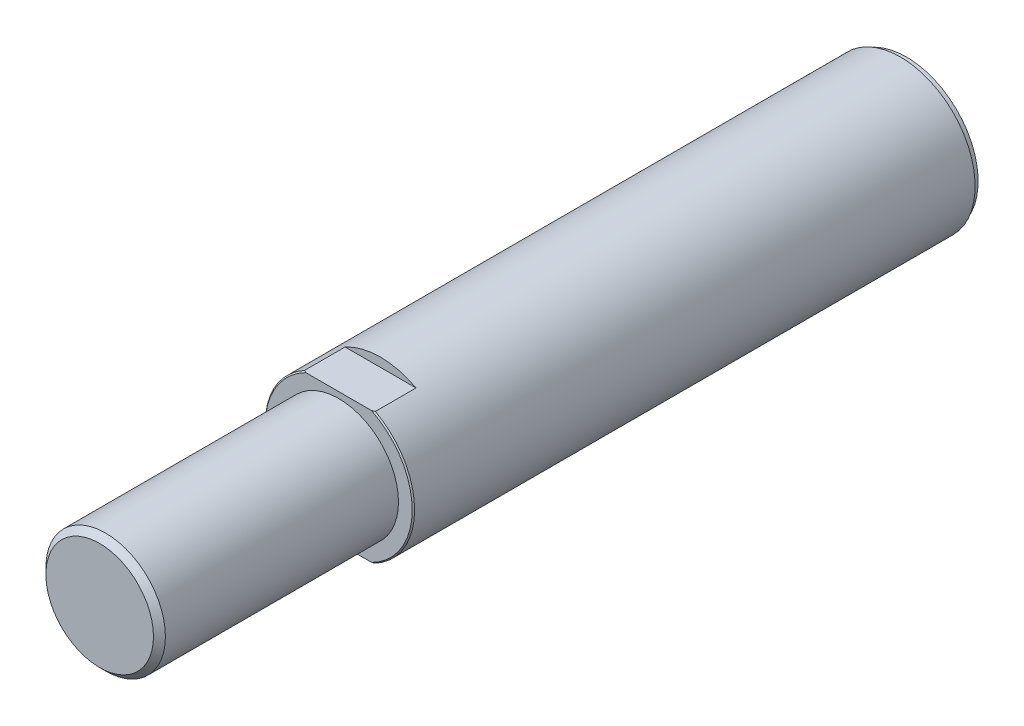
from build123d import *

# Parameters (mm, degrees)
ESBO_O1_R                       = 12.5
RESSALTO_EXTRUS_O1_DEPTH        = 135
ESBO_O2_OUTSIDE_W               = 54.91
ESBO_O2_OUTSIDE_H               = 54.91
ESBO_O2_OUTSIDE_R               = 10
CORTE_EXTRUS_O1_DEPTH           = 40
FURO_ROSCADO_DE_M12X1_751_D     = 10.2
FURO_ROSCADO_DE_M12X1_751_DEPTH = 32.75
FURO_ROSCADO_DE_M12X1_751_TIP   = 3.064389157
ESBO_O5_OUTSIDE_W               = 54.91
ESBO_O5_OUTSIDE_H               = 54.91
ESBO_O5_OUTSIDE_R               = 12
CORTE_EXTRUS_O2_DEPTH           = 1
CHANFRO1_SIZE                   = 0.2
CHANFRO2_SIZE                   = 1
ESBO_O6_OUTSIDE_W               = 54.91
ESBO_O6_OUTSIDE_H               = 54.91
ESBO_O6_OUTSIDE_W_2             = 42.182879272
ESBO_O6_OUTSIDE_H_2             = 22
CORTE_EXTRUS_O3_DEPTH           = 7


with BuildPart() as part:
    # Esbo_o1 → Ressalto-extrus_o1 (new body)
    with BuildSketch(Plane.XY):
        Circle(ESBO_O1_R)
    extrude(amount=RESSALTO_EXTRUS_O1_DEPTH)

    # Esbo_o2 outside → Corte-extrus_o1 (cut)
    with BuildSketch(Plane.XY.offset(135)):
        Rectangle(ESBO_O2_OUTSIDE_W, ESBO_O2_OUTSIDE_H)
        Circle(ESBO_O2_OUTSIDE_R, mode=Mode.SUBTRACT)
    extrude(amount=-CORTE_EXTRUS_O1_DEPTH, mode=Mode.SUBTRACT)

    # Furo roscado de M12x1.751
    with Locations(Plane(origin=(0, 0, 0), x_dir=(-1, 0, 0), z_dir=(0, 0, -1))):
        with Locations((0, 0)):
            Hole(FURO_ROSCADO_DE_M12X1_751_D / 2, depth=FURO_ROSCADO_DE_M12X1_751_DEPTH)
            with Locations((0, 0, -(FURO_ROSCADO_DE_M12X1_751_DEPTH + FURO_ROSCADO_DE_M12X1_751_TIP / 2))):  # 118° drill point
                Cone(0, FURO_ROSCADO_DE_M12X1_751_D / 2, FURO_ROSCADO_DE_M12X1_751_TIP, mode=Mode.SUBTRACT)

    # Esbo_o5 outside → Corte-extrus_o2 (cut)
    with BuildSketch(Plane(origin=(0, 0, 0), x_dir=(-1, 0, 0), z_dir=(0, 0, -1))):
        Rectangle(ESBO_O5_OUTSIDE_W, ESBO_O5_OUTSIDE_H)
        Circle(ESBO_O5_OUTSIDE_R, mode=Mode.SUBTRACT)
    extrude(amount=-CORTE_EXTRUS_O2_DEPTH, mode=Mode.SUBTRACT)

    # Chanfro1
    chanfro1_edges = [part.edges().sort_by_distance(p)[0] for p in [
        (-12.5, 0, 95),
    ]]
    chamfer(chanfro1_edges, length=CHANFRO1_SIZE)

    # Chanfro2
    chanfro2_edges = [part.edges().sort_by_distance(p)[0] for p in [
        (-10, 0, 135),
    ]]
    chamfer(chanfro2_edges, length=CHANFRO2_SIZE)

    # Esbo_o6 outside → Corte-extrus_o3 (cut)
    with BuildSketch(Plane.XY.offset(95)):
        Rectangle(ESBO_O6_OUTSIDE_W, ESBO_O6_OUTSIDE_H)
        Rectangle(ESBO_O6_OUTSIDE_W_2, ESBO_O6_OUTSIDE_H_2, mode=Mode.SUBTRACT)
    extrude(amount=-CORTE_EXTRUS_O3_DEPTH, mode=Mode.SUBTRACT)


solid = part.part
